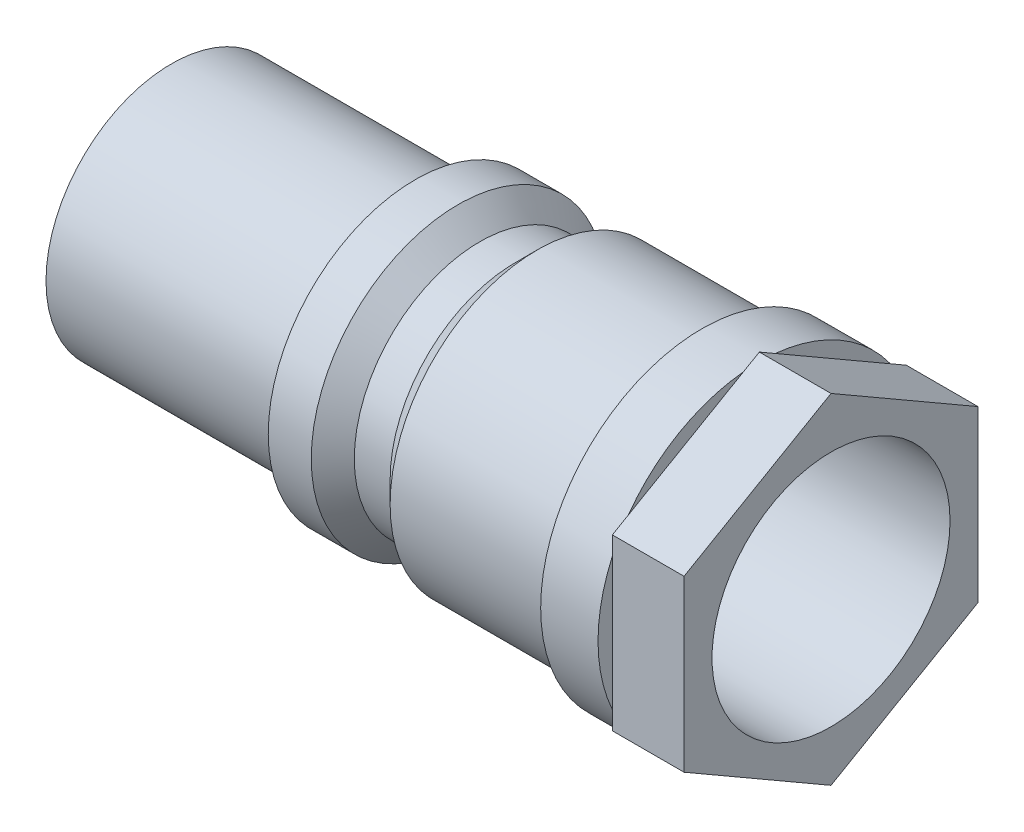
from build123d import *

# Parameters (mm, degrees)
SALIENTE_EXTRUIR1_DEPTH = 10
CROQUIS3_R              = 16.6
CORTAR_EXTRUIR1_DEPTH   = 98.624706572


with BuildPart() as part:
    # Croquis1 → Revoluci_n1 (revolve)
    with BuildSketch(Plane.XY, mode=Mode.PRIVATE) as revoluci_n1_sk:
        Polygon((0, 0), (0, 17.5), (34, 17.5), (34, 20.5), (40, 20.5), (43, 17.5), (48, 17.5), (51, 20.5), (74, 20.5), (74, 22.5), (82, 22.5), (82, 0), align=None)
    revolve(revoluci_n1_sk.sketch.rotate(Axis((0, 0, 0), (1, 0, 0)), 90), axis=Axis((0, 0, 0), (1, 0, 0)))

    # Croquis2 → Saliente-Extruir1 (add)
    with BuildSketch(Plane(origin=(82, 0, 0), x_dir=(0, 0, -1), z_dir=(1, 0, 0))):
        Polygon((0, 23.671361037), (-20.5, 11.835680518), (-20.5, -11.835680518), (0, -23.671361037), (20.5, -11.835680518), (20.5, 11.835680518), align=None)
    extrude(amount=SALIENTE_EXTRUIR1_DEPTH)

    # Croquis3 → Cortar-Extruir1 (cut, through all)
    with BuildSketch(Plane(origin=(92, 0, 0), x_dir=(0, 0, -1), z_dir=(1, 0, 0))):
        Circle(CROQUIS3_R)
    extrude(amount=-CORTAR_EXTRUIR1_DEPTH, mode=Mode.SUBTRACT)


solid = part.part
